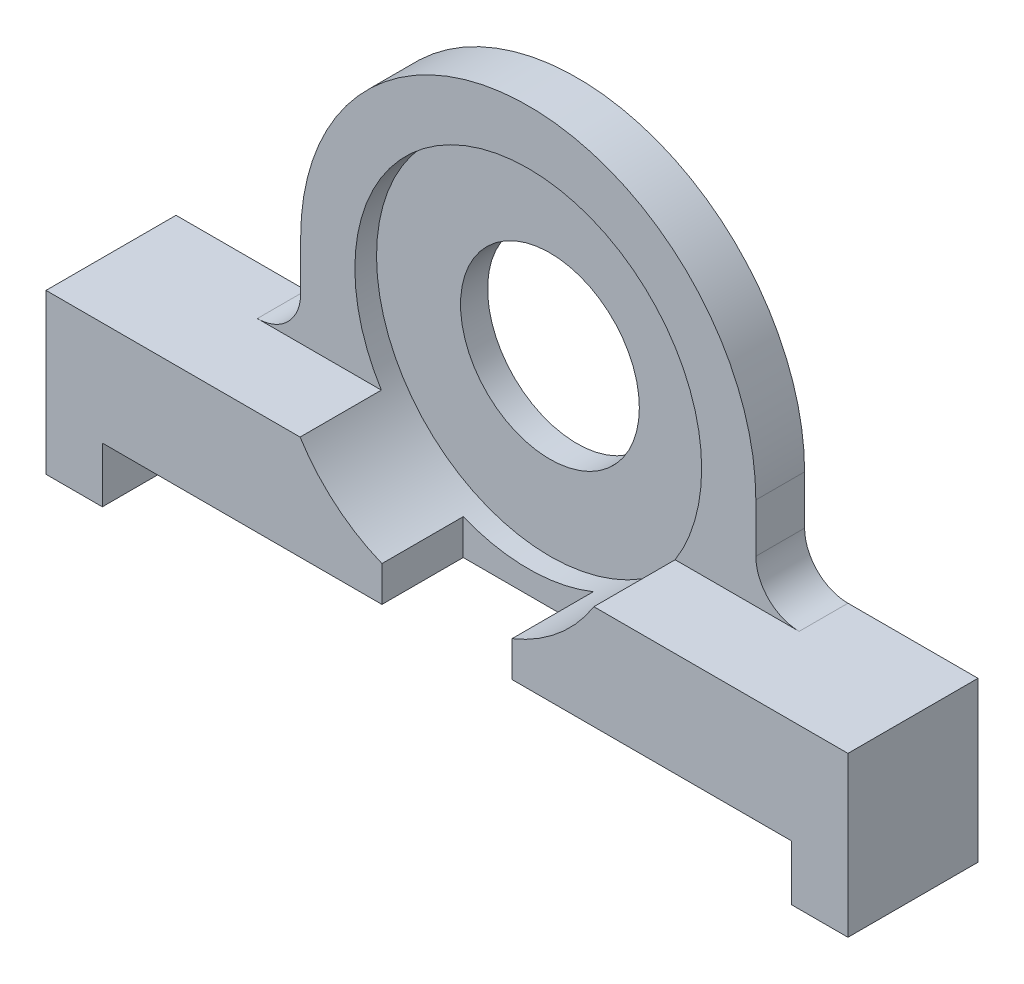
from build123d import *

# Parameters (mm, degrees)
SKETCH2_R           = 16
BOSS_EXTRUDE1_DEPTH = 12
SKETCH3_R           = 16
SKETCH3_R_2         = 8.25
BOSS_EXTRUDE2_DEPTH = 2.5
SKETCH8_W           = 54
SKETCH8_H           = 10.7
CUT_EXTRUDE4_DEPTH  = 1
CUT_EXTRUDE5_REACH  = 60.683
SKETCH9_W           = 43.6
SKETCH9_H           = 5.1
SKETCH10_R          = 1.25
CUT_EXTRUDE6_DEPTH  = 9
CUT_EXTRUDE7_START  = -7.5
CUT_EXTRUDE7_DEPTH  = 7.5
FILETE1_R           = 2
FILETE2_R           = 4
SKETCH12_W          = 10
SKETCH12_H          = 5.1
CUT_EXTRUDE8_DEPTH  = 7
SKETCH15_W          = 12
SKETCH15_H          = 3.267603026
CUT_EXTRUDE10_DEPTH = 7.5


with BuildPart() as part:
    # Sketch2 → Boss-Extrude1 (new body)
    with BuildSketch(Plane.XY):
        with BuildLine():
            Line((-21, 0), (21, 0))
            Line((21, 0), (37, 0))
            Line((37, 0), (37, 14.7))
            Line((37, 14.7), (21, 14.7))
            Line((21, 14.7), (21, 23.2))
            ThreePointArc((21, 23.2), (0, 44.2), (-21, 23.2))
            Line((-21, 23.2), (-21, 14.7))
            Line((-21, 14.7), (-37, 14.7))
            Line((-37, 14.7), (-37, 0))
            Line((-37, 0), (-21, 0))
        make_face()
        with Locations((0, 23.2)):
            Circle(SKETCH2_R, mode=Mode.SUBTRACT)
    extrude(amount=BOSS_EXTRUDE1_DEPTH)

    # Sketch3 → Boss-Extrude2 (add)
    with BuildSketch(Plane.XY):
        with Locations((0, 23.2)):
            Circle(SKETCH3_R)
        with Locations((0, 23.2)):
            Circle(SKETCH3_R_2, mode=Mode.SUBTRACT)
    extrude(amount=BOSS_EXTRUDE2_DEPTH)

    # Sketch8 → Cut-Extrude4 (cut)
    with BuildSketch(Plane.XY):
        with Locations((0, 5.35)):
            Rectangle(SKETCH8_W, SKETCH8_H)
    extrude(amount=CUT_EXTRUDE4_DEPTH, mode=Mode.SUBTRACT)

    # Sketch9 → Cut-Extrude5 (cut, up to next)
    with BuildSketch(Plane(origin=(0, 0, 1), x_dir=(-1, 0, 0), z_dir=(0, 0, -1)), mode=Mode.PRIVATE) as cut_extrude5_sk1:
        with Locations((0, 2.55)):
            Rectangle(SKETCH9_W, SKETCH9_H)
    cut_extrude5_tool1 = extrude(cut_extrude5_sk1.sketch, amount=-CUT_EXTRUDE5_REACH, mode=Mode.PRIVATE) & part.part
    add(cut_extrude5_tool1.solids().sort_by_distance((0, 2.55, 1))[0], mode=Mode.SUBTRACT)

    # Sketch10 → Cut-Extrude6 (cut)
    with BuildSketch(Plane.XZ):
        with Locations((-34, 9)):
            Circle(SKETCH10_R)
        with Locations((-34, 3)):
            Circle(SKETCH10_R)
        with Locations(Location((34, 3, 0), (0, 0, 180))):
            Circle(SKETCH10_R)
        with Locations(Location((34, 9, 0), (0, 0, 180))):
            Circle(SKETCH10_R)
    extrude(amount=-CUT_EXTRUDE6_DEPTH, mode=Mode.SUBTRACT)

    # Sketch11 → Cut-Extrude7 (cut)
    with BuildSketch(Plane.XY.offset(12).offset(CUT_EXTRUDE7_START)):
        with BuildLine():
            Line((21, 14.7), (21, 23.2))
            ThreePointArc((21, 23.2), (0, 44.2), (-21, 23.2))
            Line((-21, 23.2), (-21, 14.7))
            Line((-21, 14.7), (21, 14.7))
        make_face()
    extrude(amount=CUT_EXTRUDE7_DEPTH, mode=Mode.SUBTRACT)

    # Filete1
    filete1_edges = [part.edges().sort_by_distance(p)[0] for p in [
        (-27, 10.7, 0.5),
        (27, 10.7, 0.5),
    ]]
    fillet(filete1_edges, radius=FILETE1_R)

    # Filete2
    filete2_edges = [part.edges().sort_by_distance(p)[0] for p in [
        (-21, 14.7, 2.25),
        (21, 14.7, 2.25),
    ]]
    fillet(filete2_edges, radius=FILETE2_R)

    # Sketch12 → Cut-Extrude8 (cut)
    with BuildSketch(Plane.XY.offset(12)):
        with Locations((26.8, 2.55)):
            Rectangle(SKETCH12_W, SKETCH12_H)
        with Locations((-26.8, 2.55)):
            Rectangle(SKETCH12_W, SKETCH12_H)
    extrude(amount=-CUT_EXTRUDE8_DEPTH, mode=Mode.SUBTRACT)

    # Sketch15 → Cut-Extrude10 (cut)
    with BuildSketch(Plane.XY.offset(12)):
        with Locations((0, 6.733801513)):
            Rectangle(SKETCH15_W, SKETCH15_H)
    extrude(amount=-CUT_EXTRUDE10_DEPTH, mode=Mode.SUBTRACT)


solid = part.part
